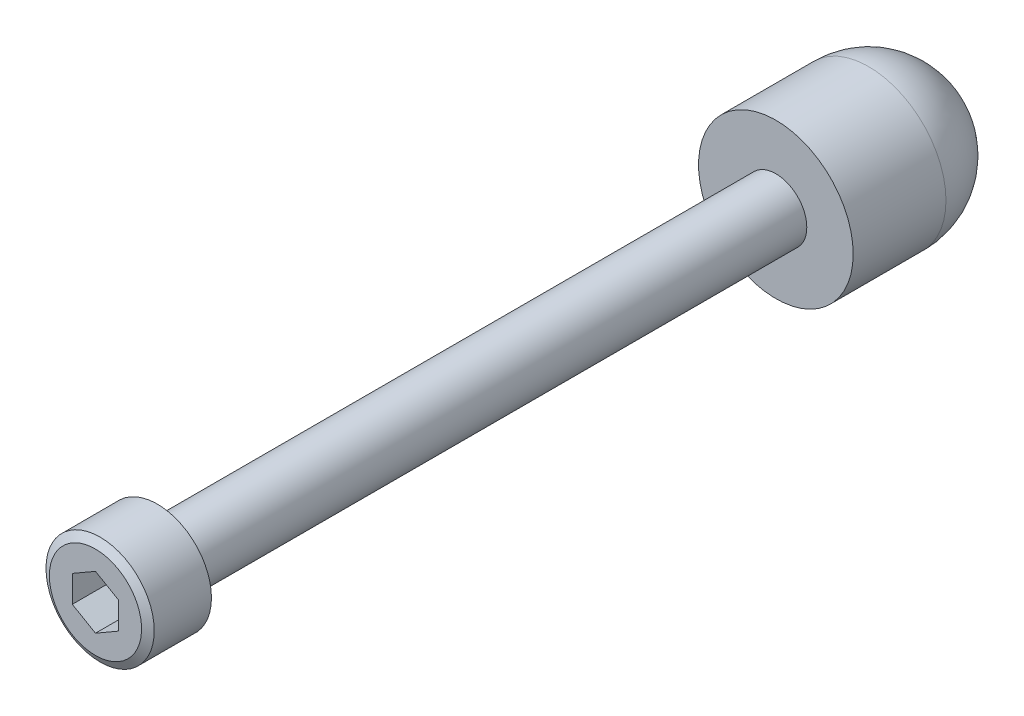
ISO-10303-21;
HEADER;
FILE_DESCRIPTION(('STEP AP214'),'2;1');
FILE_NAME('part.step','',(''),(''),'','','');
FILE_SCHEMA(('AUTOMOTIVE_DESIGN { 1 0 10303 214 1 1 1 1 }'));
ENDSEC;
DATA;
#1=APPLICATION_CONTEXT('core data for automotive mechanical design processes');
#2=APPLICATION_PROTOCOL_DEFINITION('international standard','automotive_design',2000,#1);
#3=PRODUCT_CONTEXT('',#1,'mechanical');
#4=PRODUCT('Part','Part','',(#3));
#5=PRODUCT_RELATED_PRODUCT_CATEGORY('part','',(#4));
#6=PRODUCT_DEFINITION_FORMATION('','',#4);
#7=PRODUCT_DEFINITION_CONTEXT('part definition',#1,'design');
#8=PRODUCT_DEFINITION('design','',#6,#7);
#9=PRODUCT_DEFINITION_SHAPE('','',#8);
#10=(LENGTH_UNIT() NAMED_UNIT(*) SI_UNIT(.MILLI.,.METRE.));
#11=(NAMED_UNIT(*) PLANE_ANGLE_UNIT() SI_UNIT($,.RADIAN.));
#12=(NAMED_UNIT(*) SI_UNIT($,.STERADIAN.) SOLID_ANGLE_UNIT());
#13=UNCERTAINTY_MEASURE_WITH_UNIT(LENGTH_MEASURE(1.E-05),#10,'distance_accuracy_value','');
#14=(GEOMETRIC_REPRESENTATION_CONTEXT(3) GLOBAL_UNCERTAINTY_ASSIGNED_CONTEXT((#13)) GLOBAL_UNIT_ASSIGNED_CONTEXT((#10,
#11,#12)) REPRESENTATION_CONTEXT('',''));
#15=CARTESIAN_POINT('',(0.,0.,0.));
#16=DIRECTION('',(0.,0.,1.));
#17=DIRECTION('',(1.,0.,0.));
#18=AXIS2_PLACEMENT_3D('',#15,#16,#17);
#19=CARTESIAN_POINT('',(0.,4.99999644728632E-08,5.));
#20=DIRECTION('',(0.,0.,1.));
#21=DIRECTION('',(0.,-1.,0.));
#22=AXIS2_PLACEMENT_3D('',#19,#20,#21);
#23=SPHERICAL_SURFACE('',#22,5.);
#24=CARTESIAN_POINT('',(0.,0.,0.));
#25=VERTEX_POINT('',#24);
#26=VERTEX_LOOP('',#25);
#27=FACE_BOUND('',#26,.T.);
#28=CARTESIAN_POINT('',(0.,4.99999644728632E-08,5.));
#29=DIRECTION('',(0.,0.,1.));
#30=DIRECTION('',(1.,0.,0.));
#31=AXIS2_PLACEMENT_3D('',#28,#29,#30);
#32=CIRCLE('',#31,5.);
#33=CARTESIAN_POINT('',(5.,4.99999644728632E-08,5.));
#34=VERTEX_POINT('',#33);
#35=EDGE_CURVE('E116',#34,#34,#32,.T.);
#36=ORIENTED_EDGE('',*,*,#35,.F.);
#37=EDGE_LOOP('',(#36));
#38=FACE_BOUND('',#37,.T.);
#39=ADVANCED_FACE('F14',(#27,#38),#23,.T.);
#40=CARTESIAN_POINT('',(0.,4.99999644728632E-08,5.));
#41=DIRECTION('',(0.,0.,1.));
#42=DIRECTION('',(1.,0.,0.));
#43=AXIS2_PLACEMENT_3D('',#40,#41,#42);
#44=CYLINDRICAL_SURFACE('',#43,5.);
#45=ORIENTED_EDGE('',*,*,#35,.T.);
#46=EDGE_LOOP('',(#45));
#47=FACE_BOUND('',#46,.T.);
#48=CARTESIAN_POINT('',(0.,4.99999644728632E-08,11.));
#49=DIRECTION('',(0.,0.,1.));
#50=DIRECTION('',(1.,0.,0.));
#51=AXIS2_PLACEMENT_3D('',#48,#49,#50);
#52=CIRCLE('',#51,5.);
#53=CARTESIAN_POINT('',(5.,4.99999644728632E-08,11.));
#54=VERTEX_POINT('',#53);
#55=EDGE_CURVE('E18',#54,#54,#52,.T.);
#56=ORIENTED_EDGE('',*,*,#55,.F.);
#57=EDGE_LOOP('',(#56));
#58=FACE_BOUND('',#57,.T.);
#59=ADVANCED_FACE('F130',(#47,#58),#44,.T.);
#60=CARTESIAN_POINT('',(-5.06,-5.07741125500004,11.));
#61=DIRECTION('',(0.,0.,1.));
#62=DIRECTION('',(1.,0.,0.));
#63=AXIS2_PLACEMENT_3D('',#60,#61,#62);
#64=PLANE('',#63);
#65=CARTESIAN_POINT('',(0.,4.99999644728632E-08,11.));
#66=DIRECTION('',(0.,0.,1.));
#67=DIRECTION('',(1.,0.,0.));
#68=AXIS2_PLACEMENT_3D('',#65,#66,#67);
#69=CIRCLE('',#68,2.);
#70=CARTESIAN_POINT('',(2.,4.99999644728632E-08,11.));
#71=VERTEX_POINT('',#70);
#72=EDGE_CURVE('E170',#71,#71,#69,.T.);
#73=ORIENTED_EDGE('',*,*,#72,.F.);
#74=EDGE_LOOP('',(#73));
#75=FACE_BOUND('',#74,.T.);
#76=ORIENTED_EDGE('',*,*,#55,.T.);
#77=EDGE_LOOP('',(#76));
#78=FACE_BOUND('',#77,.T.);
#79=ADVANCED_FACE('F134',(#75,#78),#64,.T.);
#80=CARTESIAN_POINT('',(0.,4.99999644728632E-08,11.));
#81=DIRECTION('',(0.,0.,1.));
#82=DIRECTION('',(1.,0.,0.));
#83=AXIS2_PLACEMENT_3D('',#80,#81,#82);
#84=CYLINDRICAL_SURFACE('',#83,2.);
#85=ORIENTED_EDGE('',*,*,#72,.T.);
#86=EDGE_LOOP('',(#85));
#87=FACE_BOUND('',#86,.T.);
#88=CARTESIAN_POINT('',(0.,4.99999644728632E-08,51.));
#89=DIRECTION('',(0.,0.,1.));
#90=DIRECTION('',(1.,0.,0.));
#91=AXIS2_PLACEMENT_3D('',#88,#89,#90);
#92=CIRCLE('',#91,2.);
#93=CARTESIAN_POINT('',(2.,4.99999644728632E-08,51.));
#94=VERTEX_POINT('',#93);
#95=EDGE_CURVE('E165',#94,#94,#92,.T.);
#96=ORIENTED_EDGE('',*,*,#95,.F.);
#97=EDGE_LOOP('',(#96));
#98=FACE_BOUND('',#97,.T.);
#99=ADVANCED_FACE('F136',(#87,#98),#84,.T.);
#100=CARTESIAN_POINT('',(-3.016149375,-3.02652780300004,55.));
#101=DIRECTION('',(0.,0.,1.));
#102=DIRECTION('',(1.,0.,0.));
#103=AXIS2_PLACEMENT_3D('',#100,#101,#102);
#104=PLANE('',#103);
#105=DIRECTION('',(-0.866025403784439,0.5,0.));
#106=VECTOR('',#105,1.);
#107=CARTESIAN_POINT('',(1.5,0.866025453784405,55.));
#108=LINE('',#107,#106);
#109=CARTESIAN_POINT('',(1.5,0.866025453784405,55.));
#110=VERTEX_POINT('',#109);
#111=CARTESIAN_POINT('',(0.,1.73205085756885,55.));
#112=VERTEX_POINT('',#111);
#113=EDGE_CURVE('E31',#110,#112,#108,.T.);
#114=ORIENTED_EDGE('',*,*,#113,.F.);
#115=DIRECTION('',(0.,1.,0.));
#116=VECTOR('',#115,1.);
#117=CARTESIAN_POINT('',(1.5,-0.866025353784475,55.));
#118=LINE('',#117,#116);
#119=CARTESIAN_POINT('',(1.5,-0.866025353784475,55.));
#120=VERTEX_POINT('',#119);
#121=EDGE_CURVE('E90',#120,#110,#118,.T.);
#122=ORIENTED_EDGE('',*,*,#121,.F.);
#123=DIRECTION('',(0.866025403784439,0.5,0.));
#124=VECTOR('',#123,1.);
#125=CARTESIAN_POINT('',(0.,-1.73205075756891,55.));
#126=LINE('',#125,#124);
#127=CARTESIAN_POINT('',(0.,-1.73205075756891,55.));
#128=VERTEX_POINT('',#127);
#129=EDGE_CURVE('E93',#128,#120,#126,.T.);
#130=ORIENTED_EDGE('',*,*,#129,.F.);
#131=DIRECTION('',(0.866025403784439,-0.5,0.));
#132=VECTOR('',#131,1.);
#133=CARTESIAN_POINT('',(-1.5,-0.866025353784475,55.));
#134=LINE('',#133,#132);
#135=CARTESIAN_POINT('',(-1.5,-0.866025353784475,55.));
#136=VERTEX_POINT('',#135);
#137=EDGE_CURVE('E109',#136,#128,#134,.T.);
#138=ORIENTED_EDGE('',*,*,#137,.F.);
#139=DIRECTION('',(0.,-1.,0.));
#140=VECTOR('',#139,1.);
#141=CARTESIAN_POINT('',(-1.5,0.866025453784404,55.));
#142=LINE('',#141,#140);
#143=CARTESIAN_POINT('',(-1.5,0.866025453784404,55.));
#144=VERTEX_POINT('',#143);
#145=EDGE_CURVE('E106',#144,#136,#142,.T.);
#146=ORIENTED_EDGE('',*,*,#145,.F.);
#147=DIRECTION('',(-0.866025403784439,-0.5,0.));
#148=VECTOR('',#147,1.);
#149=CARTESIAN_POINT('',(0.,1.73205085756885,55.));
#150=LINE('',#149,#148);
#151=EDGE_CURVE('E104',#112,#144,#150,.T.);
#152=ORIENTED_EDGE('',*,*,#151,.F.);
#153=EDGE_LOOP('',(#114,#122,#130,#138,#146,#152));
#154=FACE_BOUND('',#153,.T.);
#155=CARTESIAN_POINT('',(0.,4.99999644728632E-08,55.));
#156=DIRECTION('',(0.,0.,-1.));
#157=DIRECTION('',(-1.,0.,0.));
#158=AXIS2_PLACEMENT_3D('',#155,#156,#157);
#159=CIRCLE('',#158,2.980384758);
#160=CARTESIAN_POINT('',(-2.980384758,4.99999644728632E-08,55.));
#161=VERTEX_POINT('',#160);
#162=EDGE_CURVE('E163',#161,#161,#159,.T.);
#163=ORIENTED_EDGE('',*,*,#162,.F.);
#164=EDGE_LOOP('',(#163));
#165=FACE_BOUND('',#164,.T.);
#166=ADVANCED_FACE('F139',(#154,#165),#104,.T.);
#167=CARTESIAN_POINT('',(3.542,-3.55418786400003,51.));
#168=DIRECTION('',(0.,0.,-1.));
#169=DIRECTION('',(-1.,0.,0.));
#170=AXIS2_PLACEMENT_3D('',#167,#168,#169);
#171=PLANE('',#170);
#172=ORIENTED_EDGE('',*,*,#95,.T.);
#173=EDGE_LOOP('',(#172));
#174=FACE_BOUND('',#173,.T.);
#175=CARTESIAN_POINT('',(0.,4.99999644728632E-08,51.));
#176=DIRECTION('',(0.,0.,1.));
#177=DIRECTION('',(1.,0.,0.));
#178=AXIS2_PLACEMENT_3D('',#175,#176,#177);
#179=CIRCLE('',#178,3.5);
#180=CARTESIAN_POINT('',(3.5,4.99999644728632E-08,51.));
#181=VERTEX_POINT('',#180);
#182=EDGE_CURVE('E23',#181,#181,#179,.T.);
#183=ORIENTED_EDGE('',*,*,#182,.F.);
#184=EDGE_LOOP('',(#183));
#185=FACE_BOUND('',#184,.T.);
#186=ADVANCED_FACE('F16',(#174,#185),#171,.T.);
#187=CARTESIAN_POINT('',(0.,4.99999644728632E-08,55.));
#188=DIRECTION('',(0.,0.,-1.));
#189=DIRECTION('',(-1.,0.,0.));
#190=AXIS2_PLACEMENT_3D('',#187,#188,#189);
#191=CONICAL_SURFACE('',#190,2.980384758,1.04719755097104);
#192=CARTESIAN_POINT('',(0.,4.99999644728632E-08,54.7));
#193=DIRECTION('',(0.,0.,1.));
#194=DIRECTION('',(1.,0.,0.));
#195=AXIS2_PLACEMENT_3D('',#192,#193,#194);
#196=CIRCLE('',#195,3.5);
#197=CARTESIAN_POINT('',(3.5,4.99999644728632E-08,54.7));
#198=VERTEX_POINT('',#197);
#199=EDGE_CURVE('E9',#198,#198,#196,.F.);
#200=ORIENTED_EDGE('',*,*,#199,.F.);
#201=EDGE_LOOP('',(#200));
#202=FACE_BOUND('',#201,.T.);
#203=ORIENTED_EDGE('',*,*,#162,.T.);
#204=EDGE_LOOP('',(#203));
#205=FACE_BOUND('',#204,.T.);
#206=ADVANCED_FACE('F141',(#202,#205),#191,.T.);
#207=CARTESIAN_POINT('',(0.,4.99999644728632E-08,51.));
#208=DIRECTION('',(0.,0.,1.));
#209=DIRECTION('',(1.,0.,0.));
#210=AXIS2_PLACEMENT_3D('',#207,#208,#209);
#211=CYLINDRICAL_SURFACE('',#210,3.5);
#212=ORIENTED_EDGE('',*,*,#199,.T.);
#213=EDGE_LOOP('',(#212));
#214=FACE_BOUND('',#213,.T.);
#215=ORIENTED_EDGE('',*,*,#182,.T.);
#216=EDGE_LOOP('',(#215));
#217=FACE_BOUND('',#216,.T.);
#218=ADVANCED_FACE('F144',(#214,#217),#211,.T.);
#219=CARTESIAN_POINT('',(1.5,0.866025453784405,52.8));
#220=DIRECTION('',(0.5,0.866025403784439,0.));
#221=DIRECTION('',(-0.866025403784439,0.5,0.));
#222=AXIS2_PLACEMENT_3D('',#219,#220,#221);
#223=PLANE('',#222);
#224=ORIENTED_EDGE('',*,*,#113,.T.);
#225=DIRECTION('',(0.,0.,1.));
#226=VECTOR('',#225,1.);
#227=CARTESIAN_POINT('',(0.,1.73205085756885,52.8));
#228=LINE('',#227,#226);
#229=CARTESIAN_POINT('',(0.,1.73205085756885,52.8));
#230=VERTEX_POINT('',#229);
#231=EDGE_CURVE('E67',#230,#112,#228,.T.);
#232=ORIENTED_EDGE('',*,*,#231,.F.);
#233=DIRECTION('',(-0.866025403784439,0.5,0.));
#234=VECTOR('',#233,1.);
#235=CARTESIAN_POINT('',(1.5,0.866025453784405,52.8));
#236=LINE('',#235,#234);
#237=CARTESIAN_POINT('',(1.5,0.866025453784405,52.8));
#238=VERTEX_POINT('',#237);
#239=EDGE_CURVE('E71',#238,#230,#236,.T.);
#240=ORIENTED_EDGE('',*,*,#239,.F.);
#241=DIRECTION('',(0.,0.,1.));
#242=VECTOR('',#241,1.);
#243=CARTESIAN_POINT('',(1.5,0.866025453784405,52.8));
#244=LINE('',#243,#242);
#245=EDGE_CURVE('E114',#238,#110,#244,.T.);
#246=ORIENTED_EDGE('',*,*,#245,.T.);
#247=EDGE_LOOP('',(#224,#232,#240,#246));
#248=FACE_BOUND('',#247,.T.);
#249=ADVANCED_FACE('F69',(#248),#223,.F.);
#250=CARTESIAN_POINT('',(1.5,-0.866025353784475,52.8));
#251=DIRECTION('',(1.,0.,0.));
#252=DIRECTION('',(0.,0.,-1.));
#253=AXIS2_PLACEMENT_3D('',#250,#251,#252);
#254=PLANE('',#253);
#255=ORIENTED_EDGE('',*,*,#121,.T.);
#256=ORIENTED_EDGE('',*,*,#245,.F.);
#257=DIRECTION('',(0.,1.,0.));
#258=VECTOR('',#257,1.);
#259=CARTESIAN_POINT('',(1.5,-0.866025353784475,52.8));
#260=LINE('',#259,#258);
#261=CARTESIAN_POINT('',(1.5,-0.866025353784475,52.8));
#262=VERTEX_POINT('',#261);
#263=EDGE_CURVE('E77',#262,#238,#260,.T.);
#264=ORIENTED_EDGE('',*,*,#263,.F.);
#265=DIRECTION('',(0.,0.,1.));
#266=VECTOR('',#265,1.);
#267=CARTESIAN_POINT('',(1.5,-0.866025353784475,52.8));
#268=LINE('',#267,#266);
#269=EDGE_CURVE('E117',#262,#120,#268,.T.);
#270=ORIENTED_EDGE('',*,*,#269,.T.);
#271=EDGE_LOOP('',(#255,#256,#264,#270));
#272=FACE_BOUND('',#271,.T.);
#273=ADVANCED_FACE('F198',(#272),#254,.F.);
#274=CARTESIAN_POINT('',(0.,-1.73205075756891,52.8));
#275=DIRECTION('',(0.5,-0.866025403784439,0.));
#276=DIRECTION('',(0.866025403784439,0.5,0.));
#277=AXIS2_PLACEMENT_3D('',#274,#275,#276);
#278=PLANE('',#277);
#279=ORIENTED_EDGE('',*,*,#129,.T.);
#280=ORIENTED_EDGE('',*,*,#269,.F.);
#281=DIRECTION('',(0.866025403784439,0.5,0.));
#282=VECTOR('',#281,1.);
#283=CARTESIAN_POINT('',(0.,-1.73205075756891,52.8));
#284=LINE('',#283,#282);
#285=CARTESIAN_POINT('',(0.,-1.73205075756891,52.8));
#286=VERTEX_POINT('',#285);
#287=EDGE_CURVE('E100',#286,#262,#284,.T.);
#288=ORIENTED_EDGE('',*,*,#287,.F.);
#289=DIRECTION('',(0.,0.,1.));
#290=VECTOR('',#289,1.);
#291=CARTESIAN_POINT('',(0.,-1.73205075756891,52.8));
#292=LINE('',#291,#290);
#293=EDGE_CURVE('E119',#286,#128,#292,.T.);
#294=ORIENTED_EDGE('',*,*,#293,.T.);
#295=EDGE_LOOP('',(#279,#280,#288,#294));
#296=FACE_BOUND('',#295,.T.);
#297=ADVANCED_FACE('F196',(#296),#278,.F.);
#298=CARTESIAN_POINT('',(-1.5,-0.866025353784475,52.8));
#299=DIRECTION('',(-0.5,-0.866025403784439,0.));
#300=DIRECTION('',(0.866025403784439,-0.5,0.));
#301=AXIS2_PLACEMENT_3D('',#298,#299,#300);
#302=PLANE('',#301);
#303=ORIENTED_EDGE('',*,*,#137,.T.);
#304=ORIENTED_EDGE('',*,*,#293,.F.);
#305=DIRECTION('',(0.866025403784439,-0.5,0.));
#306=VECTOR('',#305,1.);
#307=CARTESIAN_POINT('',(-1.5,-0.866025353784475,52.8));
#308=LINE('',#307,#306);
#309=CARTESIAN_POINT('',(-1.5,-0.866025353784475,52.8));
#310=VERTEX_POINT('',#309);
#311=EDGE_CURVE('E97',#310,#286,#308,.T.);
#312=ORIENTED_EDGE('',*,*,#311,.F.);
#313=DIRECTION('',(0.,0.,1.));
#314=VECTOR('',#313,1.);
#315=CARTESIAN_POINT('',(-1.5,-0.866025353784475,52.8));
#316=LINE('',#315,#314);
#317=EDGE_CURVE('E121',#310,#136,#316,.T.);
#318=ORIENTED_EDGE('',*,*,#317,.T.);
#319=EDGE_LOOP('',(#303,#304,#312,#318));
#320=FACE_BOUND('',#319,.T.);
#321=ADVANCED_FACE('F194',(#320),#302,.F.);
#322=CARTESIAN_POINT('',(-1.5,0.866025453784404,52.8));
#323=DIRECTION('',(-1.,0.,0.));
#324=DIRECTION('',(0.,-1.,0.));
#325=AXIS2_PLACEMENT_3D('',#322,#323,#324);
#326=PLANE('',#325);
#327=ORIENTED_EDGE('',*,*,#145,.T.);
#328=ORIENTED_EDGE('',*,*,#317,.F.);
#329=DIRECTION('',(0.,-1.,0.));
#330=VECTOR('',#329,1.);
#331=CARTESIAN_POINT('',(-1.5,0.866025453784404,52.8));
#332=LINE('',#331,#330);
#333=CARTESIAN_POINT('',(-1.5,0.866025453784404,52.8));
#334=VERTEX_POINT('',#333);
#335=EDGE_CURVE('E85',#334,#310,#332,.T.);
#336=ORIENTED_EDGE('',*,*,#335,.F.);
#337=DIRECTION('',(0.,0.,1.));
#338=VECTOR('',#337,1.);
#339=CARTESIAN_POINT('',(-1.5,0.866025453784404,52.8));
#340=LINE('',#339,#338);
#341=EDGE_CURVE('E76',#334,#144,#340,.T.);
#342=ORIENTED_EDGE('',*,*,#341,.T.);
#343=EDGE_LOOP('',(#327,#328,#336,#342));
#344=FACE_BOUND('',#343,.T.);
#345=ADVANCED_FACE('F190',(#344),#326,.F.);
#346=CARTESIAN_POINT('',(0.,1.73205085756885,52.8));
#347=DIRECTION('',(-0.5,0.866025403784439,0.));
#348=DIRECTION('',(-0.866025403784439,-0.5,0.));
#349=AXIS2_PLACEMENT_3D('',#346,#347,#348);
#350=PLANE('',#349);
#351=ORIENTED_EDGE('',*,*,#151,.T.);
#352=ORIENTED_EDGE('',*,*,#341,.F.);
#353=DIRECTION('',(-0.866025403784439,-0.5,0.));
#354=VECTOR('',#353,1.);
#355=CARTESIAN_POINT('',(0.,1.73205085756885,52.8));
#356=LINE('',#355,#354);
#357=EDGE_CURVE('E80',#230,#334,#356,.T.);
#358=ORIENTED_EDGE('',*,*,#357,.F.);
#359=ORIENTED_EDGE('',*,*,#231,.T.);
#360=EDGE_LOOP('',(#351,#352,#358,#359));
#361=FACE_BOUND('',#360,.T.);
#362=ADVANCED_FACE('F81',(#361),#350,.F.);
#363=CARTESIAN_POINT('',(0.,1.73205085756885,52.8));
#364=DIRECTION('',(0.,0.,1.));
#365=DIRECTION('',(1.,0.,0.));
#366=AXIS2_PLACEMENT_3D('',#363,#364,#365);
#367=PLANE('',#366);
#368=ORIENTED_EDGE('',*,*,#239,.T.);
#369=ORIENTED_EDGE('',*,*,#357,.T.);
#370=ORIENTED_EDGE('',*,*,#335,.T.);
#371=ORIENTED_EDGE('',*,*,#311,.T.);
#372=ORIENTED_EDGE('',*,*,#287,.T.);
#373=ORIENTED_EDGE('',*,*,#263,.T.);
#374=EDGE_LOOP('',(#368,#369,#370,#371,#372,#373));
#375=FACE_BOUND('',#374,.T.);
#376=ADVANCED_FACE('F87',(#375),#367,.T.);
#377=CLOSED_SHELL('',(#39,#59,#79,#99,#166,#186,#206,#218,#249,#273,#297,#321,#345,#362,#376));
#378=MANIFOLD_SOLID_BREP('B1',#377);
#379=ADVANCED_BREP_SHAPE_REPRESENTATION('',(#18,#378),#14);
#380=SHAPE_DEFINITION_REPRESENTATION(#9,#379);
ENDSEC;
END-ISO-10303-21;
